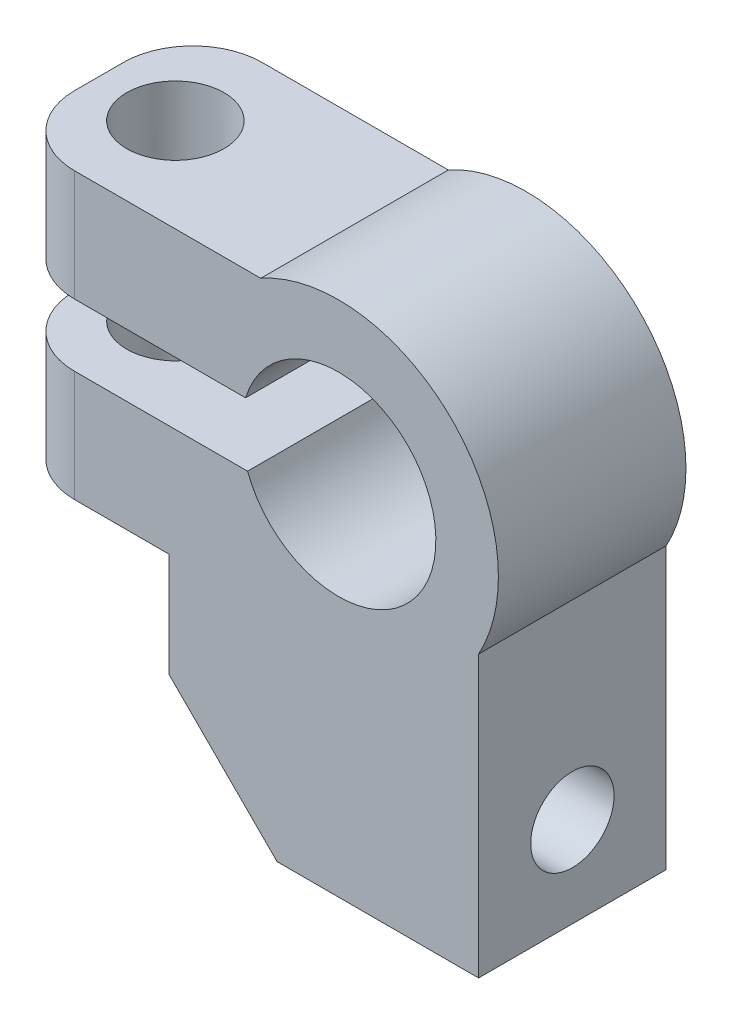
ISO-10303-21;
HEADER;
FILE_DESCRIPTION(('STEP AP214'),'2;1');
FILE_NAME('part.step','',(''),(''),'','','');
FILE_SCHEMA(('AUTOMOTIVE_DESIGN { 1 0 10303 214 1 1 1 1 }'));
ENDSEC;
DATA;
#1=APPLICATION_CONTEXT('core data for automotive mechanical design processes');
#2=APPLICATION_PROTOCOL_DEFINITION('international standard','automotive_design',2000,#1);
#3=PRODUCT_CONTEXT('',#1,'mechanical');
#4=PRODUCT('Part','Part','',(#3));
#5=PRODUCT_RELATED_PRODUCT_CATEGORY('part','',(#4));
#6=PRODUCT_DEFINITION_FORMATION('','',#4);
#7=PRODUCT_DEFINITION_CONTEXT('part definition',#1,'design');
#8=PRODUCT_DEFINITION('design','',#6,#7);
#9=PRODUCT_DEFINITION_SHAPE('','',#8);
#10=(LENGTH_UNIT() NAMED_UNIT(*) SI_UNIT(.MILLI.,.METRE.));
#11=(NAMED_UNIT(*) PLANE_ANGLE_UNIT() SI_UNIT($,.RADIAN.));
#12=(NAMED_UNIT(*) SI_UNIT($,.STERADIAN.) SOLID_ANGLE_UNIT());
#13=UNCERTAINTY_MEASURE_WITH_UNIT(LENGTH_MEASURE(1.E-05),#10,'distance_accuracy_value','');
#14=(GEOMETRIC_REPRESENTATION_CONTEXT(3) GLOBAL_UNCERTAINTY_ASSIGNED_CONTEXT((#13)) GLOBAL_UNIT_ASSIGNED_CONTEXT((#10,
#11,#12)) REPRESENTATION_CONTEXT('',''));
#15=CARTESIAN_POINT('',(0.,0.,0.));
#16=DIRECTION('',(0.,0.,1.));
#17=DIRECTION('',(1.,0.,0.));
#18=AXIS2_PLACEMENT_3D('',#15,#16,#17);
#19=CARTESIAN_POINT('',(0.,0.,27.));
#20=DIRECTION('',(0.,0.,-1.));
#21=DIRECTION('',(-1.,0.,0.));
#22=AXIS2_PLACEMENT_3D('',#19,#20,#21);
#23=CYLINDRICAL_SURFACE('',#22,23.);
#24=CARTESIAN_POINT('',(0.,0.,0.));
#25=DIRECTION('',(0.,0.,1.));
#26=DIRECTION('',(1.,0.,0.));
#27=AXIS2_PLACEMENT_3D('',#24,#25,#26);
#28=CIRCLE('',#27,23.);
#29=CARTESIAN_POINT('',(20.150447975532,-11.0887080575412,0.));
#30=VERTEX_POINT('',#29);
#31=CARTESIAN_POINT('',(-11.2074539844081,20.0846452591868,0.));
#32=VERTEX_POINT('',#31);
#33=EDGE_CURVE('E175',#30,#32,#28,.T.);
#34=ORIENTED_EDGE('',*,*,#33,.T.);
#35=DIRECTION('',(0.,0.,-1.));
#36=VECTOR('',#35,1.);
#37=CARTESIAN_POINT('',(-11.2074539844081,20.0846452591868,27.));
#38=LINE('',#37,#36);
#39=CARTESIAN_POINT('',(-11.2074539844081,20.0846452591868,27.));
#40=VERTEX_POINT('',#39);
#41=EDGE_CURVE('E252',#40,#32,#38,.T.);
#42=ORIENTED_EDGE('',*,*,#41,.F.);
#43=CARTESIAN_POINT('',(0.,0.,27.));
#44=DIRECTION('',(0.,0.,1.));
#45=DIRECTION('',(1.,0.,0.));
#46=AXIS2_PLACEMENT_3D('',#43,#44,#45);
#47=CIRCLE('',#46,23.);
#48=CARTESIAN_POINT('',(20.150447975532,-11.0887080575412,27.));
#49=VERTEX_POINT('',#48);
#50=EDGE_CURVE('E197',#49,#40,#47,.T.);
#51=ORIENTED_EDGE('',*,*,#50,.F.);
#52=DIRECTION('',(0.,0.,-1.));
#53=VECTOR('',#52,1.);
#54=CARTESIAN_POINT('',(20.150447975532,-11.0887080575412,27.));
#55=LINE('',#54,#53);
#56=EDGE_CURVE('E220',#49,#30,#55,.T.);
#57=ORIENTED_EDGE('',*,*,#56,.T.);
#58=EDGE_LOOP('',(#34,#42,#51,#57));
#59=FACE_BOUND('',#58,.T.);
#60=ADVANCED_FACE('F34',(#59),#23,.T.);
#61=CARTESIAN_POINT('',(-11.2074539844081,20.0846452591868,27.));
#62=DIRECTION('',(0.,-1.,0.));
#63=DIRECTION('',(1.,0.,0.));
#64=AXIS2_PLACEMENT_3D('',#61,#62,#63);
#65=PLANE('',#64);
#66=CARTESIAN_POINT('',(-37.,20.0846452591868,13.5));
#67=DIRECTION('',(0.,-1.,0.));
#68=DIRECTION('',(1.,0.,0.));
#69=AXIS2_PLACEMENT_3D('',#66,#67,#68);
#70=CIRCLE('',#69,7.);
#71=CARTESIAN_POINT('',(-30.,20.0846452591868,13.5));
#72=VERTEX_POINT('',#71);
#73=EDGE_CURVE('E172',#72,#72,#70,.T.);
#74=ORIENTED_EDGE('',*,*,#73,.T.);
#75=EDGE_LOOP('',(#74));
#76=FACE_BOUND('',#75,.T.);
#77=DIRECTION('',(0.,0.,-1.));
#78=VECTOR('',#77,1.);
#79=CARTESIAN_POINT('',(-48.,20.0846452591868,27.));
#80=LINE('',#79,#78);
#81=CARTESIAN_POINT('',(-48.,20.0846452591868,17.));
#82=VERTEX_POINT('',#81);
#83=CARTESIAN_POINT('',(-48.,20.0846452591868,9.99999999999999));
#84=VERTEX_POINT('',#83);
#85=EDGE_CURVE('E249',#82,#84,#80,.T.);
#86=ORIENTED_EDGE('',*,*,#85,.F.);
#87=CARTESIAN_POINT('',(-38.,20.0846452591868,17.));
#88=DIRECTION('',(0.,-1.,0.));
#89=DIRECTION('',(1.,0.,0.));
#90=AXIS2_PLACEMENT_3D('',#87,#88,#89);
#91=CIRCLE('',#90,10.);
#92=CARTESIAN_POINT('',(-38.,20.0846452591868,27.));
#93=VERTEX_POINT('',#92);
#94=EDGE_CURVE('E272',#82,#93,#91,.F.);
#95=ORIENTED_EDGE('',*,*,#94,.T.);
#96=DIRECTION('',(-1.,0.,0.));
#97=VECTOR('',#96,1.);
#98=CARTESIAN_POINT('',(-11.2074539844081,20.0846452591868,27.));
#99=LINE('',#98,#97);
#100=EDGE_CURVE('E200',#40,#93,#99,.T.);
#101=ORIENTED_EDGE('',*,*,#100,.F.);
#102=ORIENTED_EDGE('',*,*,#41,.T.);
#103=DIRECTION('',(-1.,0.,0.));
#104=VECTOR('',#103,1.);
#105=CARTESIAN_POINT('',(-11.2074539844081,20.0846452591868,0.));
#106=LINE('',#105,#104);
#107=CARTESIAN_POINT('',(-38.,20.0846452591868,0.));
#108=VERTEX_POINT('',#107);
#109=EDGE_CURVE('E178',#32,#108,#106,.T.);
#110=ORIENTED_EDGE('',*,*,#109,.T.);
#111=CARTESIAN_POINT('',(-38.,20.0846452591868,9.99999999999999));
#112=DIRECTION('',(0.,-1.,0.));
#113=DIRECTION('',(1.,0.,0.));
#114=AXIS2_PLACEMENT_3D('',#111,#112,#113);
#115=CIRCLE('',#114,10.);
#116=EDGE_CURVE('E270',#108,#84,#115,.F.);
#117=ORIENTED_EDGE('',*,*,#116,.T.);
#118=EDGE_LOOP('',(#86,#95,#101,#102,#110,#117));
#119=FACE_BOUND('',#118,.T.);
#120=ADVANCED_FACE('F364',(#76,#119),#65,.F.);
#121=CARTESIAN_POINT('',(-48.,20.0846452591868,27.));
#122=DIRECTION('',(1.,0.,0.));
#123=DIRECTION('',(0.,0.,-1.));
#124=AXIS2_PLACEMENT_3D('',#121,#122,#123);
#125=PLANE('',#124);
#126=DIRECTION('',(0.,0.,-1.));
#127=VECTOR('',#126,1.);
#128=CARTESIAN_POINT('',(-48.,4.08464525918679,27.));
#129=LINE('',#128,#127);
#130=CARTESIAN_POINT('',(-48.,4.08464525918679,17.));
#131=VERTEX_POINT('',#130);
#132=CARTESIAN_POINT('',(-48.,4.08464525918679,9.99999999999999));
#133=VERTEX_POINT('',#132);
#134=EDGE_CURVE('E246',#131,#133,#129,.T.);
#135=ORIENTED_EDGE('',*,*,#134,.F.);
#136=DIRECTION('',(0.,-1.,0.));
#137=VECTOR('',#136,1.);
#138=CARTESIAN_POINT('',(-48.,20.0846452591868,17.));
#139=LINE('',#138,#137);
#140=EDGE_CURVE('E268',#131,#82,#139,.F.);
#141=ORIENTED_EDGE('',*,*,#140,.T.);
#142=ORIENTED_EDGE('',*,*,#85,.T.);
#143=DIRECTION('',(0.,-1.,0.));
#144=VECTOR('',#143,1.);
#145=CARTESIAN_POINT('',(-48.,20.0846452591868,9.99999999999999));
#146=LINE('',#145,#144);
#147=EDGE_CURVE('E265',#84,#133,#146,.T.);
#148=ORIENTED_EDGE('',*,*,#147,.T.);
#149=EDGE_LOOP('',(#135,#141,#142,#148));
#150=FACE_BOUND('',#149,.T.);
#151=ADVANCED_FACE('F343',(#150),#125,.F.);
#152=CARTESIAN_POINT('',(-48.,4.08464525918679,27.));
#153=DIRECTION('',(0.,1.,0.));
#154=DIRECTION('',(-1.,0.,0.));
#155=AXIS2_PLACEMENT_3D('',#152,#153,#154);
#156=PLANE('',#155);
#157=CARTESIAN_POINT('',(-37.,4.08464525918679,13.5));
#158=DIRECTION('',(0.,1.,0.));
#159=DIRECTION('',(-1.,0.,0.));
#160=AXIS2_PLACEMENT_3D('',#157,#158,#159);
#161=CIRCLE('',#160,7.);
#162=CARTESIAN_POINT('',(-44.,4.08464525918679,13.5));
#163=VERTEX_POINT('',#162);
#164=EDGE_CURVE('E169',#163,#163,#161,.T.);
#165=ORIENTED_EDGE('',*,*,#164,.T.);
#166=EDGE_LOOP('',(#165));
#167=FACE_BOUND('',#166,.T.);
#168=DIRECTION('',(1.,0.,0.));
#169=VECTOR('',#168,1.);
#170=CARTESIAN_POINT('',(-48.,4.08464525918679,27.));
#171=LINE('',#170,#169);
#172=CARTESIAN_POINT('',(-38.,4.08464525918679,27.));
#173=VERTEX_POINT('',#172);
#174=CARTESIAN_POINT('',(-13.3908802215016,4.08464525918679,27.));
#175=VERTEX_POINT('',#174);
#176=EDGE_CURVE('E203',#173,#175,#171,.T.);
#177=ORIENTED_EDGE('',*,*,#176,.F.);
#178=CARTESIAN_POINT('',(-38.,4.08464525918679,17.));
#179=DIRECTION('',(0.,1.,0.));
#180=DIRECTION('',(-1.,0.,0.));
#181=AXIS2_PLACEMENT_3D('',#178,#179,#180);
#182=CIRCLE('',#181,10.);
#183=EDGE_CURVE('E263',#173,#131,#182,.F.);
#184=ORIENTED_EDGE('',*,*,#183,.T.);
#185=ORIENTED_EDGE('',*,*,#134,.T.);
#186=CARTESIAN_POINT('',(-38.,4.08464525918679,9.99999999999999));
#187=DIRECTION('',(0.,1.,0.));
#188=DIRECTION('',(-1.,0.,0.));
#189=AXIS2_PLACEMENT_3D('',#186,#187,#188);
#190=CIRCLE('',#189,10.);
#191=CARTESIAN_POINT('',(-38.,4.08464525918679,0.));
#192=VERTEX_POINT('',#191);
#193=EDGE_CURVE('E261',#133,#192,#190,.F.);
#194=ORIENTED_EDGE('',*,*,#193,.T.);
#195=DIRECTION('',(1.,0.,0.));
#196=VECTOR('',#195,1.);
#197=CARTESIAN_POINT('',(-48.,4.08464525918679,0.));
#198=LINE('',#197,#196);
#199=CARTESIAN_POINT('',(-13.3908802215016,4.08464525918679,0.));
#200=VERTEX_POINT('',#199);
#201=EDGE_CURVE('E181',#192,#200,#198,.T.);
#202=ORIENTED_EDGE('',*,*,#201,.T.);
#203=DIRECTION('',(0.,0.,-1.));
#204=VECTOR('',#203,1.);
#205=CARTESIAN_POINT('',(-13.3908802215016,4.08464525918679,27.));
#206=LINE('',#205,#204);
#207=EDGE_CURVE('E243',#175,#200,#206,.T.);
#208=ORIENTED_EDGE('',*,*,#207,.F.);
#209=EDGE_LOOP('',(#177,#184,#185,#194,#202,#208));
#210=FACE_BOUND('',#209,.T.);
#211=ADVANCED_FACE('F340',(#167,#210),#156,.F.);
#212=CARTESIAN_POINT('',(0.,0.,27.));
#213=DIRECTION('',(0.,0.,-1.));
#214=DIRECTION('',(-1.,0.,0.));
#215=AXIS2_PLACEMENT_3D('',#212,#213,#214);
#216=CYLINDRICAL_SURFACE('',#215,14.);
#217=CARTESIAN_POINT('',(0.,0.,0.));
#218=DIRECTION('',(0.,0.,-1.));
#219=DIRECTION('',(1.,0.,0.));
#220=AXIS2_PLACEMENT_3D('',#217,#218,#219);
#221=CIRCLE('',#220,14.);
#222=CARTESIAN_POINT('',(-13.1087485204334,-4.91535474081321,0.));
#223=VERTEX_POINT('',#222);
#224=EDGE_CURVE('E183',#200,#223,#221,.T.);
#225=ORIENTED_EDGE('',*,*,#224,.T.);
#226=DIRECTION('',(0.,0.,-1.));
#227=VECTOR('',#226,1.);
#228=CARTESIAN_POINT('',(-13.1087485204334,-4.91535474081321,27.));
#229=LINE('',#228,#227);
#230=CARTESIAN_POINT('',(-13.1087485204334,-4.91535474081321,27.));
#231=VERTEX_POINT('',#230);
#232=EDGE_CURVE('E240',#231,#223,#229,.T.);
#233=ORIENTED_EDGE('',*,*,#232,.F.);
#234=CARTESIAN_POINT('',(0.,0.,27.));
#235=DIRECTION('',(0.,0.,-1.));
#236=DIRECTION('',(1.,0.,0.));
#237=AXIS2_PLACEMENT_3D('',#234,#235,#236);
#238=CIRCLE('',#237,14.);
#239=EDGE_CURVE('E205',#175,#231,#238,.T.);
#240=ORIENTED_EDGE('',*,*,#239,.F.);
#241=ORIENTED_EDGE('',*,*,#207,.T.);
#242=EDGE_LOOP('',(#225,#233,#240,#241));
#243=FACE_BOUND('',#242,.T.);
#244=ADVANCED_FACE('F352',(#243),#216,.F.);
#245=CARTESIAN_POINT('',(-13.1087485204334,-4.91535474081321,27.));
#246=DIRECTION('',(0.,-1.,0.));
#247=DIRECTION('',(1.,0.,0.));
#248=AXIS2_PLACEMENT_3D('',#245,#246,#247);
#249=PLANE('',#248);
#250=CARTESIAN_POINT('',(-37.,-4.91535474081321,13.5));
#251=DIRECTION('',(0.,-1.,0.));
#252=DIRECTION('',(1.,0.,0.));
#253=AXIS2_PLACEMENT_3D('',#250,#251,#252);
#254=CIRCLE('',#253,7.);
#255=CARTESIAN_POINT('',(-30.,-4.91535474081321,13.5));
#256=VERTEX_POINT('',#255);
#257=EDGE_CURVE('E166',#256,#256,#254,.T.);
#258=ORIENTED_EDGE('',*,*,#257,.T.);
#259=EDGE_LOOP('',(#258));
#260=FACE_BOUND('',#259,.T.);
#261=DIRECTION('',(0.,0.,-1.));
#262=VECTOR('',#261,1.);
#263=CARTESIAN_POINT('',(-48.,-4.91535474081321,27.));
#264=LINE('',#263,#262);
#265=CARTESIAN_POINT('',(-48.,-4.91535474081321,17.));
#266=VERTEX_POINT('',#265);
#267=CARTESIAN_POINT('',(-48.,-4.91535474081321,9.99999999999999));
#268=VERTEX_POINT('',#267);
#269=EDGE_CURVE('E238',#266,#268,#264,.T.);
#270=ORIENTED_EDGE('',*,*,#269,.F.);
#271=CARTESIAN_POINT('',(-38.,-4.91535474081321,17.));
#272=DIRECTION('',(0.,-1.,0.));
#273=DIRECTION('',(1.,0.,0.));
#274=AXIS2_PLACEMENT_3D('',#271,#272,#273);
#275=CIRCLE('',#274,10.);
#276=CARTESIAN_POINT('',(-38.,-4.91535474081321,27.));
#277=VERTEX_POINT('',#276);
#278=EDGE_CURVE('E284',#266,#277,#275,.F.);
#279=ORIENTED_EDGE('',*,*,#278,.T.);
#280=DIRECTION('',(-1.,0.,0.));
#281=VECTOR('',#280,1.);
#282=CARTESIAN_POINT('',(-13.1087485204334,-4.91535474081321,27.));
#283=LINE('',#282,#281);
#284=EDGE_CURVE('E207',#231,#277,#283,.T.);
#285=ORIENTED_EDGE('',*,*,#284,.F.);
#286=ORIENTED_EDGE('',*,*,#232,.T.);
#287=DIRECTION('',(-1.,0.,0.));
#288=VECTOR('',#287,1.);
#289=CARTESIAN_POINT('',(-13.1087485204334,-4.91535474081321,0.));
#290=LINE('',#289,#288);
#291=CARTESIAN_POINT('',(-38.,-4.91535474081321,0.));
#292=VERTEX_POINT('',#291);
#293=EDGE_CURVE('E185',#223,#292,#290,.T.);
#294=ORIENTED_EDGE('',*,*,#293,.T.);
#295=CARTESIAN_POINT('',(-38.,-4.91535474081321,9.99999999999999));
#296=DIRECTION('',(0.,-1.,0.));
#297=DIRECTION('',(1.,0.,0.));
#298=AXIS2_PLACEMENT_3D('',#295,#296,#297);
#299=CIRCLE('',#298,10.);
#300=EDGE_CURVE('E54',#292,#268,#299,.F.);
#301=ORIENTED_EDGE('',*,*,#300,.T.);
#302=EDGE_LOOP('',(#270,#279,#285,#286,#294,#301));
#303=FACE_BOUND('',#302,.T.);
#304=ADVANCED_FACE('F287',(#260,#303),#249,.F.);
#305=CARTESIAN_POINT('',(-48.,-4.91535474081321,27.));
#306=DIRECTION('',(1.,0.,0.));
#307=DIRECTION('',(0.,0.,-1.));
#308=AXIS2_PLACEMENT_3D('',#305,#306,#307);
#309=PLANE('',#308);
#310=DIRECTION('',(0.,0.,-1.));
#311=VECTOR('',#310,1.);
#312=CARTESIAN_POINT('',(-48.,-20.9153547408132,27.));
#313=LINE('',#312,#311);
#314=CARTESIAN_POINT('',(-48.,-20.9153547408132,17.));
#315=VERTEX_POINT('',#314);
#316=CARTESIAN_POINT('',(-48.,-20.9153547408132,9.99999999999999));
#317=VERTEX_POINT('',#316);
#318=EDGE_CURVE('E235',#315,#317,#313,.T.);
#319=ORIENTED_EDGE('',*,*,#318,.F.);
#320=DIRECTION('',(0.,-1.,0.));
#321=VECTOR('',#320,1.);
#322=CARTESIAN_POINT('',(-48.,-4.91535474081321,17.));
#323=LINE('',#322,#321);
#324=EDGE_CURVE('E281',#315,#266,#323,.F.);
#325=ORIENTED_EDGE('',*,*,#324,.T.);
#326=ORIENTED_EDGE('',*,*,#269,.T.);
#327=DIRECTION('',(0.,-1.,0.));
#328=VECTOR('',#327,1.);
#329=CARTESIAN_POINT('',(-48.,-4.91535474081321,9.99999999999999));
#330=LINE('',#329,#328);
#331=EDGE_CURVE('E278',#268,#317,#330,.T.);
#332=ORIENTED_EDGE('',*,*,#331,.T.);
#333=EDGE_LOOP('',(#319,#325,#326,#332));
#334=FACE_BOUND('',#333,.T.);
#335=ADVANCED_FACE('F302',(#334),#309,.F.);
#336=CARTESIAN_POINT('',(-48.,-20.9153547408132,27.));
#337=DIRECTION('',(0.,1.,0.));
#338=DIRECTION('',(0.,0.,1.));
#339=AXIS2_PLACEMENT_3D('',#336,#337,#338);
#340=PLANE('',#339);
#341=CARTESIAN_POINT('',(-37.,-20.9153547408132,13.5));
#342=DIRECTION('',(0.,-1.,0.));
#343=DIRECTION('',(0.,0.,-1.));
#344=AXIS2_PLACEMENT_3D('',#341,#342,#343);
#345=CIRCLE('',#344,7.);
#346=CARTESIAN_POINT('',(-37.,-20.9153547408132,6.5));
#347=VERTEX_POINT('',#346);
#348=EDGE_CURVE('E161',#347,#347,#345,.T.);
#349=ORIENTED_EDGE('',*,*,#348,.F.);
#350=EDGE_LOOP('',(#349));
#351=FACE_BOUND('',#350,.T.);
#352=DIRECTION('',(1.,0.,0.));
#353=VECTOR('',#352,1.);
#354=CARTESIAN_POINT('',(-48.,-20.9153547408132,27.));
#355=LINE('',#354,#353);
#356=CARTESIAN_POINT('',(-38.,-20.9153547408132,27.));
#357=VERTEX_POINT('',#356);
#358=CARTESIAN_POINT('',(-24.4059012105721,-20.9153547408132,27.));
#359=VERTEX_POINT('',#358);
#360=EDGE_CURVE('E210',#357,#359,#355,.T.);
#361=ORIENTED_EDGE('',*,*,#360,.F.);
#362=CARTESIAN_POINT('',(-38.,-20.9153547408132,17.));
#363=DIRECTION('',(0.,1.,0.));
#364=DIRECTION('',(0.,0.,1.));
#365=AXIS2_PLACEMENT_3D('',#362,#363,#364);
#366=CIRCLE('',#365,10.);
#367=EDGE_CURVE('E276',#357,#315,#366,.F.);
#368=ORIENTED_EDGE('',*,*,#367,.T.);
#369=ORIENTED_EDGE('',*,*,#318,.T.);
#370=CARTESIAN_POINT('',(-38.,-20.9153547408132,9.99999999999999));
#371=DIRECTION('',(0.,1.,0.));
#372=DIRECTION('',(0.,0.,1.));
#373=AXIS2_PLACEMENT_3D('',#370,#371,#372);
#374=CIRCLE('',#373,10.);
#375=CARTESIAN_POINT('',(-38.,-20.9153547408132,0.));
#376=VERTEX_POINT('',#375);
#377=EDGE_CURVE('E274',#317,#376,#374,.F.);
#378=ORIENTED_EDGE('',*,*,#377,.T.);
#379=DIRECTION('',(1.,0.,0.));
#380=VECTOR('',#379,1.);
#381=CARTESIAN_POINT('',(-48.,-20.9153547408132,0.));
#382=LINE('',#381,#380);
#383=CARTESIAN_POINT('',(-24.4059012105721,-20.9153547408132,0.));
#384=VERTEX_POINT('',#383);
#385=EDGE_CURVE('E187',#376,#384,#382,.T.);
#386=ORIENTED_EDGE('',*,*,#385,.T.);
#387=DIRECTION('',(0.,0.,-1.));
#388=VECTOR('',#387,1.);
#389=CARTESIAN_POINT('',(-24.4059012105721,-20.9153547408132,27.));
#390=LINE('',#389,#388);
#391=EDGE_CURVE('E232',#359,#384,#390,.T.);
#392=ORIENTED_EDGE('',*,*,#391,.F.);
#393=EDGE_LOOP('',(#361,#368,#369,#378,#386,#392));
#394=FACE_BOUND('',#393,.T.);
#395=ADVANCED_FACE('F299',(#351,#394),#340,.F.);
#396=CARTESIAN_POINT('',(-24.4059012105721,-20.9153547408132,27.));
#397=DIRECTION('',(1.,0.,0.));
#398=DIRECTION('',(0.,1.,0.));
#399=AXIS2_PLACEMENT_3D('',#396,#397,#398);
#400=PLANE('',#399);
#401=DIRECTION('',(0.,-1.,0.));
#402=VECTOR('',#401,1.);
#403=CARTESIAN_POINT('',(-24.4059012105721,-20.9153547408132,0.));
#404=LINE('',#403,#402);
#405=CARTESIAN_POINT('',(-24.4059012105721,-35.9153547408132,0.));
#406=VERTEX_POINT('',#405);
#407=EDGE_CURVE('E189',#384,#406,#404,.T.);
#408=ORIENTED_EDGE('',*,*,#407,.T.);
#409=DIRECTION('',(0.,0.,-1.));
#410=VECTOR('',#409,1.);
#411=CARTESIAN_POINT('',(-24.4059012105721,-35.9153547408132,27.));
#412=LINE('',#411,#410);
#413=CARTESIAN_POINT('',(-24.4059012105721,-35.9153547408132,27.));
#414=VERTEX_POINT('',#413);
#415=EDGE_CURVE('E229',#414,#406,#412,.T.);
#416=ORIENTED_EDGE('',*,*,#415,.F.);
#417=DIRECTION('',(0.,-1.,0.));
#418=VECTOR('',#417,1.);
#419=CARTESIAN_POINT('',(-24.4059012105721,-20.9153547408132,27.));
#420=LINE('',#419,#418);
#421=EDGE_CURVE('E212',#359,#414,#420,.T.);
#422=ORIENTED_EDGE('',*,*,#421,.F.);
#423=ORIENTED_EDGE('',*,*,#391,.T.);
#424=EDGE_LOOP('',(#408,#416,#422,#423));
#425=FACE_BOUND('',#424,.T.);
#426=ADVANCED_FACE('F313',(#425),#400,.F.);
#427=CARTESIAN_POINT('',(-24.4059012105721,-35.9153547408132,27.));
#428=DIRECTION('',(0.707106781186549,0.707106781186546,0.));
#429=DIRECTION('',(-0.707106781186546,0.707106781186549,0.));
#430=AXIS2_PLACEMENT_3D('',#427,#428,#429);
#431=PLANE('',#430);
#432=DIRECTION('',(0.707106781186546,-0.707106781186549,0.));
#433=VECTOR('',#432,1.);
#434=CARTESIAN_POINT('',(-24.4059012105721,-35.9153547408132,0.));
#435=LINE('',#434,#433);
#436=CARTESIAN_POINT('',(-8.84955202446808,-51.4717039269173,0.));
#437=VERTEX_POINT('',#436);
#438=EDGE_CURVE('E191',#406,#437,#435,.T.);
#439=ORIENTED_EDGE('',*,*,#438,.T.);
#440=DIRECTION('',(0.,0.,-1.));
#441=VECTOR('',#440,1.);
#442=CARTESIAN_POINT('',(-8.84955202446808,-51.4717039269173,27.));
#443=LINE('',#442,#441);
#444=CARTESIAN_POINT('',(-8.84955202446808,-51.4717039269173,27.));
#445=VERTEX_POINT('',#444);
#446=EDGE_CURVE('E226',#445,#437,#443,.T.);
#447=ORIENTED_EDGE('',*,*,#446,.F.);
#448=DIRECTION('',(0.707106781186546,-0.707106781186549,0.));
#449=VECTOR('',#448,1.);
#450=CARTESIAN_POINT('',(-24.4059012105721,-35.9153547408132,27.));
#451=LINE('',#450,#449);
#452=EDGE_CURVE('E214',#414,#445,#451,.T.);
#453=ORIENTED_EDGE('',*,*,#452,.F.);
#454=ORIENTED_EDGE('',*,*,#415,.T.);
#455=EDGE_LOOP('',(#439,#447,#453,#454));
#456=FACE_BOUND('',#455,.T.);
#457=ADVANCED_FACE('F317',(#456),#431,.F.);
#458=CARTESIAN_POINT('',(-8.84955202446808,-51.4717039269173,27.));
#459=DIRECTION('',(0.,1.,0.));
#460=DIRECTION('',(0.,0.,1.));
#461=AXIS2_PLACEMENT_3D('',#458,#459,#460);
#462=PLANE('',#461);
#463=DIRECTION('',(1.,0.,0.));
#464=VECTOR('',#463,1.);
#465=CARTESIAN_POINT('',(-8.84955202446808,-51.4717039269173,0.));
#466=LINE('',#465,#464);
#467=CARTESIAN_POINT('',(20.1504479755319,-51.4717039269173,0.));
#468=VERTEX_POINT('',#467);
#469=EDGE_CURVE('E193',#437,#468,#466,.T.);
#470=ORIENTED_EDGE('',*,*,#469,.T.);
#471=DIRECTION('',(0.,0.,-1.));
#472=VECTOR('',#471,1.);
#473=CARTESIAN_POINT('',(20.1504479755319,-51.4717039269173,27.));
#474=LINE('',#473,#472);
#475=CARTESIAN_POINT('',(20.1504479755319,-51.4717039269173,27.));
#476=VERTEX_POINT('',#475);
#477=EDGE_CURVE('E223',#476,#468,#474,.T.);
#478=ORIENTED_EDGE('',*,*,#477,.F.);
#479=DIRECTION('',(1.,0.,0.));
#480=VECTOR('',#479,1.);
#481=CARTESIAN_POINT('',(-8.84955202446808,-51.4717039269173,27.));
#482=LINE('',#481,#480);
#483=EDGE_CURVE('E216',#445,#476,#482,.T.);
#484=ORIENTED_EDGE('',*,*,#483,.F.);
#485=ORIENTED_EDGE('',*,*,#446,.T.);
#486=EDGE_LOOP('',(#470,#478,#484,#485));
#487=FACE_BOUND('',#486,.T.);
#488=ADVANCED_FACE('F324',(#487),#462,.F.);
#489=CARTESIAN_POINT('',(20.1504479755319,-51.4717039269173,27.));
#490=DIRECTION('',(-1.,0.,0.));
#491=DIRECTION('',(0.,-1.,0.));
#492=AXIS2_PLACEMENT_3D('',#489,#490,#491);
#493=PLANE('',#492);
#494=CARTESIAN_POINT('',(20.1504479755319,-38.4717039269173,13.5));
#495=DIRECTION('',(1.,0.,0.));
#496=DIRECTION('',(0.,0.,-1.));
#497=AXIS2_PLACEMENT_3D('',#494,#495,#496);
#498=CIRCLE('',#497,6.);
#499=CARTESIAN_POINT('',(20.1504479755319,-38.4717039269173,7.5));
#500=VERTEX_POINT('',#499);
#501=EDGE_CURVE('E158',#500,#500,#498,.T.);
#502=ORIENTED_EDGE('',*,*,#501,.F.);
#503=EDGE_LOOP('',(#502));
#504=FACE_BOUND('',#503,.T.);
#505=DIRECTION('',(0.,1.,0.));
#506=VECTOR('',#505,1.);
#507=CARTESIAN_POINT('',(20.1504479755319,-51.4717039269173,0.));
#508=LINE('',#507,#506);
#509=EDGE_CURVE('E195',#468,#30,#508,.T.);
#510=ORIENTED_EDGE('',*,*,#509,.T.);
#511=ORIENTED_EDGE('',*,*,#56,.F.);
#512=DIRECTION('',(0.,1.,0.));
#513=VECTOR('',#512,1.);
#514=CARTESIAN_POINT('',(20.1504479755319,-51.4717039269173,27.));
#515=LINE('',#514,#513);
#516=EDGE_CURVE('E218',#476,#49,#515,.T.);
#517=ORIENTED_EDGE('',*,*,#516,.F.);
#518=ORIENTED_EDGE('',*,*,#477,.T.);
#519=EDGE_LOOP('',(#510,#511,#517,#518));
#520=FACE_BOUND('',#519,.T.);
#521=ADVANCED_FACE('F327',(#504,#520),#493,.F.);
#522=CARTESIAN_POINT('',(0.,0.,27.));
#523=DIRECTION('',(0.,0.,1.));
#524=DIRECTION('',(1.,0.,0.));
#525=AXIS2_PLACEMENT_3D('',#522,#523,#524);
#526=PLANE('',#525);
#527=ORIENTED_EDGE('',*,*,#100,.T.);
#528=DIRECTION('',(0.,-1.,0.));
#529=VECTOR('',#528,1.);
#530=CARTESIAN_POINT('',(-38.,4.08464525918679,27.));
#531=LINE('',#530,#529);
#532=EDGE_CURVE('E258',#93,#173,#531,.T.);
#533=ORIENTED_EDGE('',*,*,#532,.T.);
#534=ORIENTED_EDGE('',*,*,#176,.T.);
#535=ORIENTED_EDGE('',*,*,#239,.T.);
#536=ORIENTED_EDGE('',*,*,#284,.T.);
#537=DIRECTION('',(0.,-1.,0.));
#538=VECTOR('',#537,1.);
#539=CARTESIAN_POINT('',(-38.,-20.9153547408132,27.));
#540=LINE('',#539,#538);
#541=EDGE_CURVE('E255',#277,#357,#540,.T.);
#542=ORIENTED_EDGE('',*,*,#541,.T.);
#543=ORIENTED_EDGE('',*,*,#360,.T.);
#544=ORIENTED_EDGE('',*,*,#421,.T.);
#545=ORIENTED_EDGE('',*,*,#452,.T.);
#546=ORIENTED_EDGE('',*,*,#483,.T.);
#547=ORIENTED_EDGE('',*,*,#516,.T.);
#548=ORIENTED_EDGE('',*,*,#50,.T.);
#549=EDGE_LOOP('',(#527,#533,#534,#535,#536,#542,#543,#544,#545,#546,#547,#548));
#550=FACE_BOUND('',#549,.T.);
#551=ADVANCED_FACE('F292',(#550),#526,.T.);
#552=CARTESIAN_POINT('',(0.,0.,0.));
#553=DIRECTION('',(0.,0.,1.));
#554=DIRECTION('',(1.,0.,0.));
#555=AXIS2_PLACEMENT_3D('',#552,#553,#554);
#556=PLANE('',#555);
#557=ORIENTED_EDGE('',*,*,#201,.F.);
#558=DIRECTION('',(0.,-1.,0.));
#559=VECTOR('',#558,1.);
#560=CARTESIAN_POINT('',(-38.,0.,0.));
#561=LINE('',#560,#559);
#562=EDGE_CURVE('E11',#192,#108,#561,.F.);
#563=ORIENTED_EDGE('',*,*,#562,.T.);
#564=ORIENTED_EDGE('',*,*,#109,.F.);
#565=ORIENTED_EDGE('',*,*,#33,.F.);
#566=ORIENTED_EDGE('',*,*,#509,.F.);
#567=ORIENTED_EDGE('',*,*,#469,.F.);
#568=ORIENTED_EDGE('',*,*,#438,.F.);
#569=ORIENTED_EDGE('',*,*,#407,.F.);
#570=ORIENTED_EDGE('',*,*,#385,.F.);
#571=DIRECTION('',(0.,-1.,0.));
#572=VECTOR('',#571,1.);
#573=CARTESIAN_POINT('',(-38.,0.,0.));
#574=LINE('',#573,#572);
#575=EDGE_CURVE('E41',#376,#292,#574,.F.);
#576=ORIENTED_EDGE('',*,*,#575,.T.);
#577=ORIENTED_EDGE('',*,*,#293,.F.);
#578=ORIENTED_EDGE('',*,*,#224,.F.);
#579=EDGE_LOOP('',(#557,#563,#564,#565,#566,#567,#568,#569,#570,#576,#577,#578));
#580=FACE_BOUND('',#579,.T.);
#581=ADVANCED_FACE('F308',(#580),#556,.F.);
#582=CARTESIAN_POINT('',(-37.,23.,13.5));
#583=DIRECTION('',(0.,-1.,0.));
#584=DIRECTION('',(0.,0.,-1.));
#585=AXIS2_PLACEMENT_3D('',#582,#583,#584);
#586=CYLINDRICAL_SURFACE('',#585,7.);
#587=ORIENTED_EDGE('',*,*,#348,.T.);
#588=EDGE_LOOP('',(#587));
#589=FACE_BOUND('',#588,.T.);
#590=ORIENTED_EDGE('',*,*,#257,.F.);
#591=EDGE_LOOP('',(#590));
#592=FACE_BOUND('',#591,.T.);
#593=ADVANCED_FACE('F377',(#589,#592),#586,.F.);
#594=ORIENTED_EDGE('',*,*,#164,.F.);
#595=EDGE_LOOP('',(#594));
#596=FACE_BOUND('',#595,.T.);
#597=ORIENTED_EDGE('',*,*,#73,.F.);
#598=EDGE_LOOP('',(#597));
#599=FACE_BOUND('',#598,.T.);
#600=ADVANCED_FACE('F375',(#596,#599),#586,.F.);
#601=CARTESIAN_POINT('',(20.1504479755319,-38.4717039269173,13.5));
#602=DIRECTION('',(1.,0.,0.));
#603=DIRECTION('',(0.,0.,-1.));
#604=AXIS2_PLACEMENT_3D('',#601,#602,#603);
#605=CYLINDRICAL_SURFACE('',#604,5.99999999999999);
#606=CARTESIAN_POINT('',(-9.84955202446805,-38.4717039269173,13.5));
#607=DIRECTION('',(1.,0.,0.));
#608=DIRECTION('',(0.,0.,-1.));
#609=AXIS2_PLACEMENT_3D('',#606,#607,#608);
#610=CIRCLE('',#609,5.99999999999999);
#611=CARTESIAN_POINT('',(-9.84955202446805,-38.4717039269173,7.50000000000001));
#612=VERTEX_POINT('',#611);
#613=EDGE_CURVE('E156',#612,#612,#610,.T.);
#614=ORIENTED_EDGE('',*,*,#613,.F.);
#615=EDGE_LOOP('',(#614));
#616=FACE_BOUND('',#615,.T.);
#617=ORIENTED_EDGE('',*,*,#501,.T.);
#618=EDGE_LOOP('',(#617));
#619=FACE_BOUND('',#618,.T.);
#620=ADVANCED_FACE('F152',(#616,#619),#605,.F.);
#621=CARTESIAN_POINT('',(-9.84955202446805,-38.4717039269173,13.5));
#622=DIRECTION('',(1.,0.,0.));
#623=DIRECTION('',(0.,0.,-1.));
#624=AXIS2_PLACEMENT_3D('',#621,#622,#623);
#625=CONICAL_SURFACE('',#624,5.99999999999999,1.02974425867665);
#626=CARTESIAN_POINT('',(-13.4547157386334,-38.4717039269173,13.5));
#627=VERTEX_POINT('',#626);
#628=VERTEX_LOOP('',#627);
#629=FACE_BOUND('',#628,.T.);
#630=ORIENTED_EDGE('',*,*,#613,.T.);
#631=EDGE_LOOP('',(#630));
#632=FACE_BOUND('',#631,.T.);
#633=ADVANCED_FACE('F148',(#629,#632),#625,.F.);
#634=CARTESIAN_POINT('',(-38.,0.,17.));
#635=DIRECTION('',(0.,1.,0.));
#636=DIRECTION('',(0.,0.,1.));
#637=AXIS2_PLACEMENT_3D('',#634,#635,#636);
#638=CYLINDRICAL_SURFACE('',#637,10.);
#639=ORIENTED_EDGE('',*,*,#94,.F.);
#640=ORIENTED_EDGE('',*,*,#140,.F.);
#641=ORIENTED_EDGE('',*,*,#183,.F.);
#642=ORIENTED_EDGE('',*,*,#532,.F.);
#643=EDGE_LOOP('',(#639,#640,#641,#642));
#644=FACE_BOUND('',#643,.T.);
#645=ADVANCED_FACE('F151',(#644),#638,.T.);
#646=CARTESIAN_POINT('',(-38.,0.,17.));
#647=DIRECTION('',(0.,1.,0.));
#648=DIRECTION('',(0.,0.,1.));
#649=AXIS2_PLACEMENT_3D('',#646,#647,#648);
#650=CYLINDRICAL_SURFACE('',#649,10.);
#651=ORIENTED_EDGE('',*,*,#278,.F.);
#652=ORIENTED_EDGE('',*,*,#324,.F.);
#653=ORIENTED_EDGE('',*,*,#367,.F.);
#654=ORIENTED_EDGE('',*,*,#541,.F.);
#655=EDGE_LOOP('',(#651,#652,#653,#654));
#656=FACE_BOUND('',#655,.T.);
#657=ADVANCED_FACE('F296',(#656),#650,.T.);
#658=CARTESIAN_POINT('',(-38.,20.0846452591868,9.99999999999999));
#659=DIRECTION('',(0.,-1.,0.));
#660=DIRECTION('',(0.,0.,-1.));
#661=AXIS2_PLACEMENT_3D('',#658,#659,#660);
#662=CYLINDRICAL_SURFACE('',#661,10.);
#663=ORIENTED_EDGE('',*,*,#116,.F.);
#664=ORIENTED_EDGE('',*,*,#562,.F.);
#665=ORIENTED_EDGE('',*,*,#193,.F.);
#666=ORIENTED_EDGE('',*,*,#147,.F.);
#667=EDGE_LOOP('',(#663,#664,#665,#666));
#668=FACE_BOUND('',#667,.T.);
#669=ADVANCED_FACE('F348',(#668),#662,.T.);
#670=CARTESIAN_POINT('',(-38.,-4.91535474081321,9.99999999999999));
#671=DIRECTION('',(0.,-1.,0.));
#672=DIRECTION('',(0.,0.,-1.));
#673=AXIS2_PLACEMENT_3D('',#670,#671,#672);
#674=CYLINDRICAL_SURFACE('',#673,10.);
#675=ORIENTED_EDGE('',*,*,#300,.F.);
#676=ORIENTED_EDGE('',*,*,#575,.F.);
#677=ORIENTED_EDGE('',*,*,#377,.F.);
#678=ORIENTED_EDGE('',*,*,#331,.F.);
#679=EDGE_LOOP('',(#675,#676,#677,#678));
#680=FACE_BOUND('',#679,.T.);
#681=ADVANCED_FACE('F305',(#680),#674,.T.);
#682=CLOSED_SHELL('',(#60,#120,#151,#211,#244,#304,#335,#395,#426,#457,#488,#521,#551,#581,#593,
#600,#620,#633,#645,#657,#669,#681));
#683=MANIFOLD_SOLID_BREP('B2',#682);
#684=ADVANCED_BREP_SHAPE_REPRESENTATION('',(#18,#683),#14);
#685=SHAPE_DEFINITION_REPRESENTATION(#9,#684);
ENDSEC;
END-ISO-10303-21;
